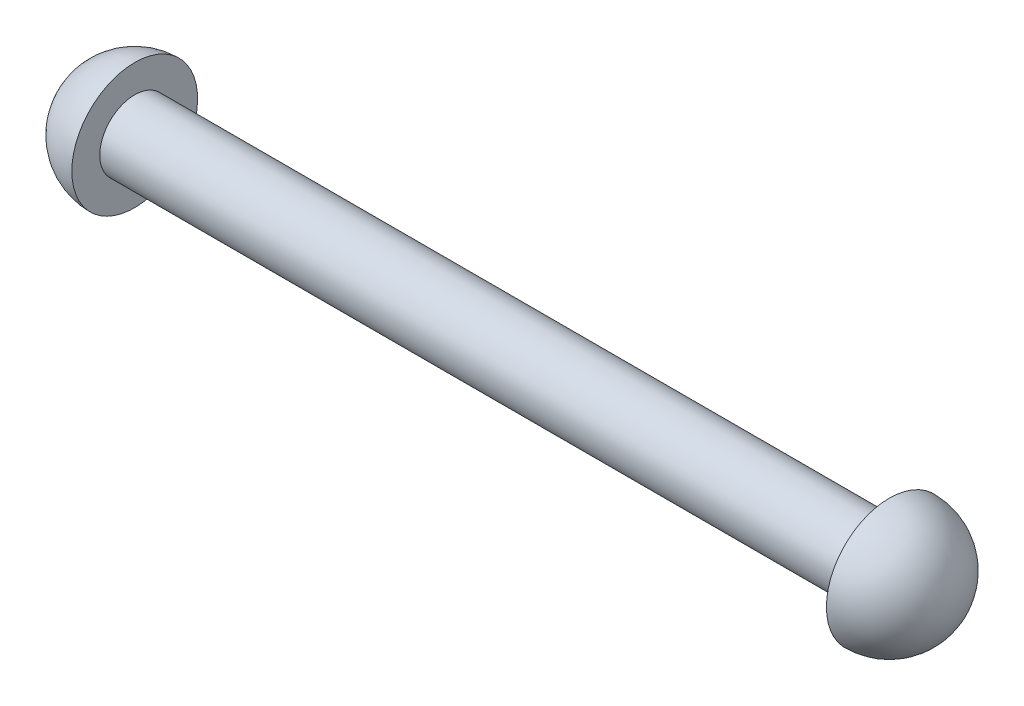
from build123d import *


with BuildPart() as part:
    # Sketch1 → Revolve1 (revolve)
    with BuildSketch(Plane.XY):
        with BuildLine():
            Line((34.29, 0), (-34.29, 0))
            Line((-34.29, 0), (-34.29, 2.54))
            ThreePointArc((-34.29, 2.54), (-38.331115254, 0.866115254), (-40.005, -3.175))
            Line((-40.005, -3.175), (40.005, -3.175))
            ThreePointArc((40.005, -3.175), (38.331115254, 0.866115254), (34.29, 2.54))
            Line((34.29, 2.54), (34.29, 0))
        make_face()
    revolve(axis=Axis((-40.005, -3.175, 0), (1, 0, 0)))


solid = part.part
